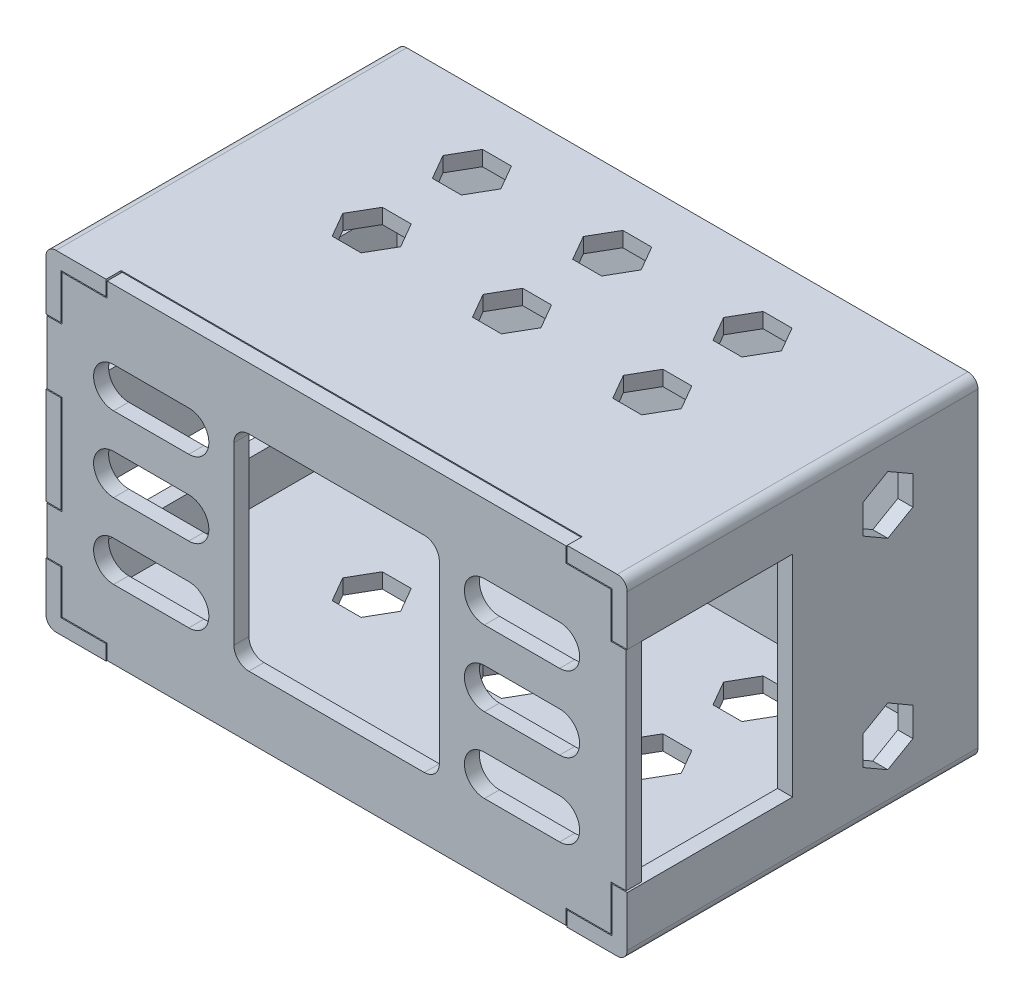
from build123d import *

# Parameters (mm, degrees)
SKETCH1_W           = 116
SKETCH1_H           = 66
SKETCH1_W_2         = 110
SKETCH1_H_2         = 60
BOSS_EXTRUDE1_DEPTH = 70
SKETCH1_2_W         = 110
SKETCH1_2_H         = 60
BOSS_EXTRUDE2_DEPTH = 3
CUT_EXTRUDE1_REACH  = 141.445
SKETCH2_W           = 65
SKETCH2_H           = 9.8
SKETCH2_H_2         = 13
CUT_EXTRUDE2_DEPTH  = 113.33877336
CUT_EXTRUDE3_REACH  = 141.445
SKETCH5_W           = 92
SKETCH5_H           = 3
SKETCH5_W_2         = 3
SKETCH5_H_2         = 42
CUT_EXTRUDE4_DEPTH  = 3
SKETCH6_W           = 2.8
SKETCH6_H           = 41.6
BOSS_EXTRUDE3_DEPTH = 3
SKETCH8_W           = 3
SKETCH8_H           = 42
CUT_EXTRUDE6_DEPTH  = 30
FILLET1_R           = 2
SKETCH9_W           = 41
SKETCH9_H           = 41
CUT_EXTRUDE7_DEPTH  = 3
FILLET2_R           = 3
CUT_EXTRUDE8_DEPTH  = 10


with BuildPart() as part:
    # Sketch1 → Boss-Extrude1 (new body)
    with BuildSketch(Plane.XY):
        Rectangle(SKETCH1_W, SKETCH1_H)
        Rectangle(SKETCH1_W_2, SKETCH1_H_2, mode=Mode.SUBTRACT)
    extrude(amount=BOSS_EXTRUDE1_DEPTH)

    # Sketch1_2 → Boss-Extrude2 (add)
    with BuildSketch(Plane.XY):
        Rectangle(SKETCH1_2_W, SKETCH1_2_H)
    extrude(amount=BOSS_EXTRUDE2_DEPTH)

    # Sketch2 → Cut-Extrude1 (cut, up to next)
    with BuildSketch(Plane.ZY.offset(58), mode=Mode.PRIVATE) as cut_extrude1_sk1:
        with Locations((37.5, -16.3)):
            Rectangle(SKETCH2_W, SKETCH2_H)
    cut_extrude1_tool1 = extrude(cut_extrude1_sk1.sketch, amount=-CUT_EXTRUDE1_REACH, mode=Mode.PRIVATE) & part.part
    # Sketch2 → Cut-Extrude1 (cut, up to next)
    with BuildSketch(Plane.ZY.offset(58), mode=Mode.PRIVATE) as cut_extrude1_sk2:
        with Locations((37.5, 14.5)):
            Rectangle(SKETCH2_W, SKETCH2_H_2)
    cut_extrude1_tool2 = extrude(cut_extrude1_sk2.sketch, amount=-CUT_EXTRUDE1_REACH, mode=Mode.PRIVATE) & part.part
    add(cut_extrude1_tool1.solids().sort_by_distance((-58, -16.3, 37.5))[0], mode=Mode.SUBTRACT)
    add(cut_extrude1_tool2.solids().sort_by_distance((-58, 14.5, 37.5))[0], mode=Mode.SUBTRACT)

    # Sketch3 → Cut-Extrude2 (cut, through all)
    with BuildSketch(Plane.XZ.offset(33)):
        Polygon((-25.113248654, 40), (-30.886751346, 40), (-33.773502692, 35), (-30.886751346, 30), (-25.113248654, 30), (-22.226497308, 35), align=None)
        Polygon((2.886751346, 40), (-2.886751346, 40), (-5.773502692, 35), (-2.886751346, 30), (2.886751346, 30), (5.773502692, 35), align=None)
        Polygon((30.886751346, 40), (25.113248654, 40), (22.226497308, 35), (25.113248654, 30), (30.886751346, 30), (33.773502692, 35), align=None)
        Polygon((30.886751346, 20), (25.113248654, 20), (22.226497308, 15), (25.113248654, 10), (30.886751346, 10), (33.773502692, 15), align=None)
        Polygon((2.886751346, 20), (-2.886751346, 20), (-5.773502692, 15), (-2.886751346, 10), (2.886751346, 10), (5.773502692, 15), align=None)
        Polygon((-25.113248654, 20), (-30.886751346, 20), (-33.773502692, 15), (-30.886751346, 10), (-25.113248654, 10), (-22.226497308, 15), align=None)
    extrude(amount=-CUT_EXTRUDE2_DEPTH, mode=Mode.SUBTRACT)

    # Sketch4 → Cut-Extrude3 (cut, up to next)
    with BuildSketch(Plane(origin=(58, 0, 0), x_dir=(0, 0, -1), z_dir=(1, 0, 0)), mode=Mode.PRIVATE) as cut_extrude3_sk1:
        Polygon((-18, 25.773502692), (-23, 22.886751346), (-23, 17.113248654), (-18, 14.226497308), (-13, 17.113248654), (-13, 22.886751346), align=None)
    cut_extrude3_tool1 = extrude(cut_extrude3_sk1.sketch, amount=-CUT_EXTRUDE3_REACH, mode=Mode.PRIVATE) & part.part
    # Sketch4 → Cut-Extrude3 (cut, up to next)
    with BuildSketch(Plane(origin=(58, 0, 0), x_dir=(0, 0, -1), z_dir=(1, 0, 0)), mode=Mode.PRIVATE) as cut_extrude3_sk2:
        Polygon((-18, -14.226497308), (-23, -17.113248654), (-23, -22.886751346), (-18, -25.773502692), (-13, -22.886751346), (-13, -17.113248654), align=None)
    cut_extrude3_tool2 = extrude(cut_extrude3_sk2.sketch, amount=-CUT_EXTRUDE3_REACH, mode=Mode.PRIVATE) & part.part
    add(cut_extrude3_tool1.solids().sort_by_distance((58, 20, 18))[0], mode=Mode.SUBTRACT)
    add(cut_extrude3_tool2.solids().sort_by_distance((58, -20, 18))[0], mode=Mode.SUBTRACT)

    # Sketch5 → Cut-Extrude4 (cut)
    with BuildSketch(Plane.XY.offset(70)):
        with Locations((0, 31.5)):
            Rectangle(SKETCH5_W, SKETCH5_H)
        with Locations((0, -31.5)):
            Rectangle(SKETCH5_W, SKETCH5_H)
        with Locations((56.5, 0)):
            Rectangle(SKETCH5_W_2, SKETCH5_H_2)
    extrude(amount=-CUT_EXTRUDE4_DEPTH, mode=Mode.SUBTRACT)

    # Sketch8 → Cut-Extrude6 (cut)
    with BuildSketch(Plane.XY.offset(67)):
        with Locations((56.5, 0)):
            Rectangle(SKETCH8_W, SKETCH8_H)
    extrude(amount=-CUT_EXTRUDE6_DEPTH, mode=Mode.SUBTRACT)

    # Fillet1
    fillet1_edges = [part.edges().sort_by_distance(p)[0] for p in [
        (-58, -33, 35),
        (-58, 33, 35),
        (58, 33, 35),
        (58, -33, 35),
    ]]
    fillet(fillet1_edges, radius=FILLET1_R)


with BuildPart() as body_2:
    # Sketch6 → Boss-Extrude3 (new body)
    with BuildSketch(Plane.XY.offset(67)):
        Polygon((55, -20.8), (55, 20.8), (54.8, 20.8), (54.8, 29.8), (45.8, 29.8), (45.8, 32.8), (-45.8, 32.8), (-45.8, 29.8), (-54.8, 29.8), (-54.8, 20.8), (-57.8, 20.8), (-57.8, 8.2), (-54.8, 8.2), (-54.8, -11.6), (-57.8, -11.6), (-57.8, -21), (-54.8, -21), (-54.8, -29.8), (-45.8, -29.8), (-45.8, -32.8), (45.8, -32.8), (45.8, -29.8), (54.8, -29.8), (54.8, -20.8), align=None)
        with Locations((56.4, 0)):
            Rectangle(SKETCH6_W, SKETCH6_H)
    extrude(amount=BOSS_EXTRUDE3_DEPTH)

    # Sketch9 → Cut-Extrude7 (cut)
    with BuildSketch(Plane.XY.offset(70)):
        Rectangle(SKETCH9_W, SKETCH9_H)
    extrude(amount=-CUT_EXTRUDE7_DEPTH, mode=Mode.SUBTRACT)

    # Fillet2
    fillet2_edges = [body_2.edges().sort_by_distance(p)[0] for p in [
        (20.5, 20.5, 68.5),
        (20.5, -20.5, 68.5),
        (-20.5, -20.5, 68.5),
        (-20.5, 20.5, 68.5),
    ]]
    fillet(fillet2_edges, radius=FILLET2_R)

    # Sketch10 → Cut-Extrude8 (cut)
    with BuildSketch(Plane.XY.offset(70)):
        with BuildLine():
            Line((-44.5, 19), (-29.5, 19))
            ThreePointArc((-29.5, 19), (-25.5, 15), (-29.5, 11))
            Line((-29.5, 11), (-44.5, 11))
            ThreePointArc((-44.5, 11), (-48.5, 15), (-44.5, 19))
        make_face()
        with BuildLine():
            Line((-44.5, 4), (-29.5, 4))
            ThreePointArc((-29.5, 4), (-25.5, 0), (-29.5, -4))
            Line((-29.5, -4), (-44.5, -4))
            ThreePointArc((-44.5, -4), (-48.5, 0), (-44.5, 4))
        make_face()
        with BuildLine():
            Line((-44.5, -11), (-29.5, -11))
            ThreePointArc((-29.5, -11), (-25.5, -15), (-29.5, -19))
            Line((-29.5, -19), (-44.5, -19))
            ThreePointArc((-44.5, -19), (-48.5, -15), (-44.5, -11))
        make_face()
        with BuildLine():
            Line((44.5, 19), (29.5, 19))
            ThreePointArc((29.5, 19), (25.5, 15), (29.5, 11))
            Line((29.5, 11), (44.5, 11))
            ThreePointArc((44.5, 11), (48.5, 15), (44.5, 19))
        make_face()
        with BuildLine():
            Line((44.5, 4), (29.5, 4))
            ThreePointArc((29.5, 4), (25.5, 0), (29.5, -4))
            Line((29.5, -4), (44.5, -4))
            ThreePointArc((44.5, -4), (48.5, 0), (44.5, 4))
        make_face()
        with BuildLine():
            Line((44.5, -11), (29.5, -11))
            ThreePointArc((29.5, -11), (25.5, -15), (29.5, -19))
            Line((29.5, -19), (44.5, -19))
            ThreePointArc((44.5, -19), (48.5, -15), (44.5, -11))
        make_face()
    extrude(amount=-CUT_EXTRUDE8_DEPTH, mode=Mode.SUBTRACT)


solid = Compound([part.part, body_2.part])
